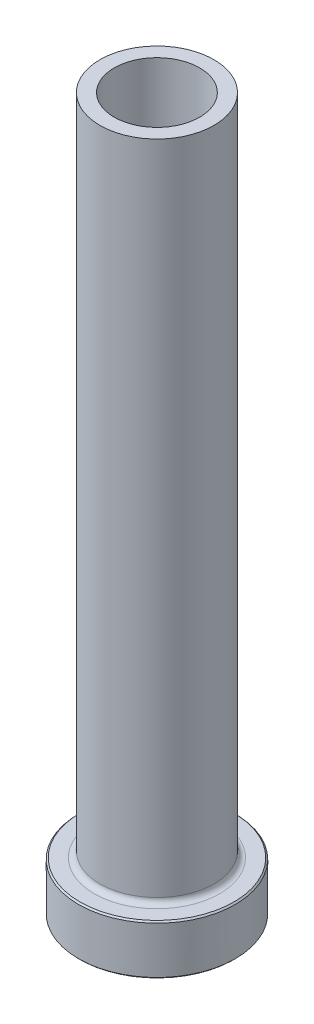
ISO-10303-21;
HEADER;
FILE_DESCRIPTION(('STEP AP214'),'2;1');
FILE_NAME('part.step','',(''),(''),'','','');
FILE_SCHEMA(('AUTOMOTIVE_DESIGN { 1 0 10303 214 1 1 1 1 }'));
ENDSEC;
DATA;
#1=APPLICATION_CONTEXT('core data for automotive mechanical design processes');
#2=APPLICATION_PROTOCOL_DEFINITION('international standard','automotive_design',2000,#1);
#3=PRODUCT_CONTEXT('',#1,'mechanical');
#4=PRODUCT('Part','Part','',(#3));
#5=PRODUCT_RELATED_PRODUCT_CATEGORY('part','',(#4));
#6=PRODUCT_DEFINITION_FORMATION('','',#4);
#7=PRODUCT_DEFINITION_CONTEXT('part definition',#1,'design');
#8=PRODUCT_DEFINITION('design','',#6,#7);
#9=PRODUCT_DEFINITION_SHAPE('','',#8);
#10=(LENGTH_UNIT() NAMED_UNIT(*) SI_UNIT(.MILLI.,.METRE.));
#11=(NAMED_UNIT(*) PLANE_ANGLE_UNIT() SI_UNIT($,.RADIAN.));
#12=(NAMED_UNIT(*) SI_UNIT($,.STERADIAN.) SOLID_ANGLE_UNIT());
#13=UNCERTAINTY_MEASURE_WITH_UNIT(LENGTH_MEASURE(1.E-05),#10,'distance_accuracy_value','');
#14=(GEOMETRIC_REPRESENTATION_CONTEXT(3) GLOBAL_UNCERTAINTY_ASSIGNED_CONTEXT((#13)) GLOBAL_UNIT_ASSIGNED_CONTEXT((#10,
#11,#12)) REPRESENTATION_CONTEXT('',''));
#15=CARTESIAN_POINT('',(0.,0.,0.));
#16=DIRECTION('',(0.,0.,1.));
#17=DIRECTION('',(1.,0.,0.));
#18=AXIS2_PLACEMENT_3D('',#15,#16,#17);
#19=CARTESIAN_POINT('',(0.,92.1876809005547,0.));
#20=DIRECTION('',(0.,1.,0.));
#21=DIRECTION('',(0.,0.,1.));
#22=AXIS2_PLACEMENT_3D('',#19,#20,#21);
#23=CYLINDRICAL_SURFACE('',#22,6.00000000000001);
#24=CARTESIAN_POINT('',(0.,100.,0.));
#25=DIRECTION('',(0.,1.,0.));
#26=DIRECTION('',(0.,0.,1.));
#27=AXIS2_PLACEMENT_3D('',#24,#25,#26);
#28=CIRCLE('',#27,6.00000000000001);
#29=CARTESIAN_POINT('',(0.,100.,6.00000000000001));
#30=VERTEX_POINT('',#29);
#31=EDGE_CURVE('E62',#30,#30,#28,.T.);
#32=ORIENTED_EDGE('',*,*,#31,.T.);
#33=EDGE_LOOP('',(#32));
#34=FACE_BOUND('',#33,.T.);
#35=CARTESIAN_POINT('',(0.,45.,0.));
#36=DIRECTION('',(0.,1.,0.));
#37=DIRECTION('',(0.,0.,1.));
#38=AXIS2_PLACEMENT_3D('',#35,#36,#37);
#39=CIRCLE('',#38,6.00000000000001);
#40=CARTESIAN_POINT('',(0.,45.,6.00000000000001));
#41=VERTEX_POINT('',#40);
#42=EDGE_CURVE('E71',#41,#41,#39,.T.);
#43=ORIENTED_EDGE('',*,*,#42,.F.);
#44=EDGE_LOOP('',(#43));
#45=FACE_BOUND('',#44,.T.);
#46=ADVANCED_FACE('F30',(#34,#45),#23,.F.);
#47=CARTESIAN_POINT('',(-6.00000000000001,100.,0.));
#48=DIRECTION('',(0.,1.,0.));
#49=DIRECTION('',(0.,0.,1.));
#50=AXIS2_PLACEMENT_3D('',#47,#48,#49);
#51=PLANE('',#50);
#52=CARTESIAN_POINT('',(0.,100.,0.));
#53=DIRECTION('',(0.,1.,0.));
#54=DIRECTION('',(0.,0.,1.));
#55=AXIS2_PLACEMENT_3D('',#52,#53,#54);
#56=CIRCLE('',#55,8.);
#57=CARTESIAN_POINT('',(0.,100.,8.));
#58=VERTEX_POINT('',#57);
#59=EDGE_CURVE('E65',#58,#58,#56,.T.);
#60=ORIENTED_EDGE('',*,*,#59,.T.);
#61=EDGE_LOOP('',(#60));
#62=FACE_BOUND('',#61,.T.);
#63=ORIENTED_EDGE('',*,*,#31,.F.);
#64=EDGE_LOOP('',(#63));
#65=FACE_BOUND('',#64,.T.);
#66=ADVANCED_FACE('F79',(#62,#65),#51,.T.);
#67=CARTESIAN_POINT('',(0.,92.1876809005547,0.));
#68=DIRECTION('',(0.,1.,0.));
#69=DIRECTION('',(0.,0.,1.));
#70=AXIS2_PLACEMENT_3D('',#67,#68,#69);
#71=CYLINDRICAL_SURFACE('',#70,7.99999999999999);
#72=CARTESIAN_POINT('',(0.,7.8,0.));
#73=DIRECTION('',(0.,1.,0.));
#74=DIRECTION('',(0.,0.,1.));
#75=AXIS2_PLACEMENT_3D('',#72,#73,#74);
#76=CIRCLE('',#75,7.99999999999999);
#77=CARTESIAN_POINT('',(0.,7.8,7.99999999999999));
#78=VERTEX_POINT('',#77);
#79=EDGE_CURVE('E59',#78,#78,#76,.T.);
#80=ORIENTED_EDGE('',*,*,#79,.T.);
#81=EDGE_LOOP('',(#80));
#82=FACE_BOUND('',#81,.T.);
#83=ORIENTED_EDGE('',*,*,#59,.F.);
#84=EDGE_LOOP('',(#83));
#85=FACE_BOUND('',#84,.T.);
#86=ADVANCED_FACE('F85',(#82,#85),#71,.T.);
#87=CARTESIAN_POINT('',(-7.99999999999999,7.,0.));
#88=DIRECTION('',(0.,1.,0.));
#89=DIRECTION('',(0.,0.,1.));
#90=AXIS2_PLACEMENT_3D('',#87,#88,#89);
#91=PLANE('',#90);
#92=CARTESIAN_POINT('',(0.,7.,0.));
#93=DIRECTION('',(0.,1.,0.));
#94=DIRECTION('',(0.,0.,1.));
#95=AXIS2_PLACEMENT_3D('',#92,#93,#94);
#96=CIRCLE('',#95,10.8);
#97=CARTESIAN_POINT('',(0.,7.,10.8));
#98=VERTEX_POINT('',#97);
#99=EDGE_CURVE('E53',#98,#98,#96,.T.);
#100=ORIENTED_EDGE('',*,*,#99,.T.);
#101=EDGE_LOOP('',(#100));
#102=FACE_BOUND('',#101,.T.);
#103=CARTESIAN_POINT('',(0.,7.,0.));
#104=DIRECTION('',(0.,1.,0.));
#105=DIRECTION('',(0.,0.,1.));
#106=AXIS2_PLACEMENT_3D('',#103,#104,#105);
#107=CIRCLE('',#106,8.8);
#108=CARTESIAN_POINT('',(0.,7.,8.8));
#109=VERTEX_POINT('',#108);
#110=EDGE_CURVE('E56',#109,#109,#107,.F.);
#111=ORIENTED_EDGE('',*,*,#110,.T.);
#112=EDGE_LOOP('',(#111));
#113=FACE_BOUND('',#112,.T.);
#114=ADVANCED_FACE('F111',(#102,#113),#91,.T.);
#115=CARTESIAN_POINT('',(0.,92.1876809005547,0.));
#116=DIRECTION('',(0.,1.,0.));
#117=DIRECTION('',(0.,0.,1.));
#118=AXIS2_PLACEMENT_3D('',#115,#116,#117);
#119=CYLINDRICAL_SURFACE('',#118,11.);
#120=CARTESIAN_POINT('',(0.,6.80000000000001,0.));
#121=DIRECTION('',(0.,1.,0.));
#122=DIRECTION('',(0.,0.,1.));
#123=AXIS2_PLACEMENT_3D('',#120,#121,#122);
#124=CIRCLE('',#123,11.);
#125=CARTESIAN_POINT('',(0.,6.80000000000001,11.));
#126=VERTEX_POINT('',#125);
#127=EDGE_CURVE('E45',#126,#126,#124,.F.);
#128=ORIENTED_EDGE('',*,*,#127,.T.);
#129=EDGE_LOOP('',(#128));
#130=FACE_BOUND('',#129,.T.);
#131=CARTESIAN_POINT('',(0.,0.20000000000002,0.));
#132=DIRECTION('',(0.,-1.,0.));
#133=DIRECTION('',(0.,0.,-1.));
#134=AXIS2_PLACEMENT_3D('',#131,#132,#133);
#135=CIRCLE('',#134,11.);
#136=CARTESIAN_POINT('',(0.,0.20000000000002,-11.));
#137=VERTEX_POINT('',#136);
#138=EDGE_CURVE('E50',#137,#137,#135,.F.);
#139=ORIENTED_EDGE('',*,*,#138,.T.);
#140=EDGE_LOOP('',(#139));
#141=FACE_BOUND('',#140,.T.);
#142=ADVANCED_FACE('F108',(#130,#141),#119,.T.);
#143=CARTESIAN_POINT('',(-11.,0.,0.));
#144=DIRECTION('',(0.,-1.,0.));
#145=DIRECTION('',(0.,0.,-1.));
#146=AXIS2_PLACEMENT_3D('',#143,#144,#145);
#147=PLANE('',#146);
#148=CARTESIAN_POINT('',(0.,0.,0.));
#149=DIRECTION('',(0.,-1.,0.));
#150=DIRECTION('',(0.,0.,-1.));
#151=AXIS2_PLACEMENT_3D('',#148,#149,#150);
#152=CIRCLE('',#151,6.75000000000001);
#153=CARTESIAN_POINT('',(0.,0.,-6.75000000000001));
#154=VERTEX_POINT('',#153);
#155=EDGE_CURVE('E37',#154,#154,#152,.F.);
#156=ORIENTED_EDGE('',*,*,#155,.T.);
#157=EDGE_LOOP('',(#156));
#158=FACE_BOUND('',#157,.T.);
#159=CARTESIAN_POINT('',(0.,0.,0.));
#160=DIRECTION('',(0.,-1.,0.));
#161=DIRECTION('',(0.,0.,-1.));
#162=AXIS2_PLACEMENT_3D('',#159,#160,#161);
#163=CIRCLE('',#162,10.8);
#164=CARTESIAN_POINT('',(0.,0.,-10.8));
#165=VERTEX_POINT('',#164);
#166=EDGE_CURVE('E41',#165,#165,#163,.T.);
#167=ORIENTED_EDGE('',*,*,#166,.T.);
#168=EDGE_LOOP('',(#167));
#169=FACE_BOUND('',#168,.T.);
#170=ADVANCED_FACE('F110',(#158,#169),#147,.T.);
#171=CARTESIAN_POINT('',(0.,92.1876809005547,0.));
#172=DIRECTION('',(0.,1.,0.));
#173=DIRECTION('',(0.,0.,1.));
#174=AXIS2_PLACEMENT_3D('',#171,#172,#173);
#175=CYLINDRICAL_SURFACE('',#174,6.24999999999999);
#176=CARTESIAN_POINT('',(0.,0.5,0.));
#177=DIRECTION('',(0.,-1.,0.));
#178=DIRECTION('',(0.,0.,-1.));
#179=AXIS2_PLACEMENT_3D('',#176,#177,#178);
#180=CIRCLE('',#179,6.24999999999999);
#181=CARTESIAN_POINT('',(0.,0.5,-6.24999999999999));
#182=VERTEX_POINT('',#181);
#183=EDGE_CURVE('E10',#182,#182,#180,.T.);
#184=ORIENTED_EDGE('',*,*,#183,.T.);
#185=EDGE_LOOP('',(#184));
#186=FACE_BOUND('',#185,.T.);
#187=CARTESIAN_POINT('',(0.,33.,0.));
#188=DIRECTION('',(0.,1.,0.));
#189=DIRECTION('',(0.,0.,1.));
#190=AXIS2_PLACEMENT_3D('',#187,#188,#189);
#191=CIRCLE('',#190,6.24999999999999);
#192=CARTESIAN_POINT('',(0.,33.,6.24999999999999));
#193=VERTEX_POINT('',#192);
#194=EDGE_CURVE('E68',#193,#193,#191,.T.);
#195=ORIENTED_EDGE('',*,*,#194,.T.);
#196=EDGE_LOOP('',(#195));
#197=FACE_BOUND('',#196,.T.);
#198=ADVANCED_FACE('F118',(#186,#197),#175,.F.);
#199=CARTESIAN_POINT('',(0.,33.,0.));
#200=DIRECTION('',(0.,-1.,0.));
#201=DIRECTION('',(0.,0.,-1.));
#202=AXIS2_PLACEMENT_3D('',#199,#200,#201);
#203=CONICAL_SURFACE('',#202,6.24999999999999,0.0208303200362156);
#204=ORIENTED_EDGE('',*,*,#42,.T.);
#205=EDGE_LOOP('',(#204));
#206=FACE_BOUND('',#205,.T.);
#207=ORIENTED_EDGE('',*,*,#194,.F.);
#208=EDGE_LOOP('',(#207));
#209=FACE_BOUND('',#208,.T.);
#210=ADVANCED_FACE('F75',(#206,#209),#203,.F.);
#211=CARTESIAN_POINT('',(0.,7.8,0.));
#212=DIRECTION('',(0.,1.,0.));
#213=DIRECTION('',(0.,0.,1.));
#214=AXIS2_PLACEMENT_3D('',#211,#212,#213);
#215=TOROIDAL_SURFACE('',#214,8.8,0.8);
#216=ORIENTED_EDGE('',*,*,#110,.F.);
#217=EDGE_LOOP('',(#216));
#218=FACE_BOUND('',#217,.T.);
#219=ORIENTED_EDGE('',*,*,#79,.F.);
#220=EDGE_LOOP('',(#219));
#221=FACE_BOUND('',#220,.T.);
#222=ADVANCED_FACE('F90',(#218,#221),#215,.F.);
#223=CARTESIAN_POINT('',(0.,7.00000000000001,0.));
#224=DIRECTION('',(0.,-1.,0.));
#225=DIRECTION('',(0.,0.,-1.));
#226=AXIS2_PLACEMENT_3D('',#223,#224,#225);
#227=CONICAL_SURFACE('',#226,10.8,0.785398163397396);
#228=ORIENTED_EDGE('',*,*,#127,.F.);
#229=EDGE_LOOP('',(#228));
#230=FACE_BOUND('',#229,.T.);
#231=ORIENTED_EDGE('',*,*,#99,.F.);
#232=EDGE_LOOP('',(#231));
#233=FACE_BOUND('',#232,.T.);
#234=ADVANCED_FACE('F93',(#230,#233),#227,.T.);
#235=CARTESIAN_POINT('',(0.,0.20000000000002,0.));
#236=DIRECTION('',(0.,1.,0.));
#237=DIRECTION('',(0.,0.,1.));
#238=AXIS2_PLACEMENT_3D('',#235,#236,#237);
#239=CONICAL_SURFACE('',#238,11.,0.785398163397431);
#240=ORIENTED_EDGE('',*,*,#166,.F.);
#241=EDGE_LOOP('',(#240));
#242=FACE_BOUND('',#241,.T.);
#243=ORIENTED_EDGE('',*,*,#138,.F.);
#244=EDGE_LOOP('',(#243));
#245=FACE_BOUND('',#244,.T.);
#246=ADVANCED_FACE('F96',(#242,#245),#239,.T.);
#247=CARTESIAN_POINT('',(0.,0.,0.));
#248=DIRECTION('',(0.,-1.,0.));
#249=DIRECTION('',(0.,0.,-1.));
#250=AXIS2_PLACEMENT_3D('',#247,#248,#249);
#251=CONICAL_SURFACE('',#250,6.75000000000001,0.785398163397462);
#252=ORIENTED_EDGE('',*,*,#183,.F.);
#253=EDGE_LOOP('',(#252));
#254=FACE_BOUND('',#253,.T.);
#255=ORIENTED_EDGE('',*,*,#155,.F.);
#256=EDGE_LOOP('',(#255));
#257=FACE_BOUND('',#256,.T.);
#258=ADVANCED_FACE('F32',(#254,#257),#251,.F.);
#259=CLOSED_SHELL('',(#46,#66,#86,#114,#142,#170,#198,#210,#222,#234,#246,#258));
#260=MANIFOLD_SOLID_BREP('B2',#259);
#261=ADVANCED_BREP_SHAPE_REPRESENTATION('',(#18,#260),#14);
#262=SHAPE_DEFINITION_REPRESENTATION(#9,#261);
ENDSEC;
END-ISO-10303-21;
